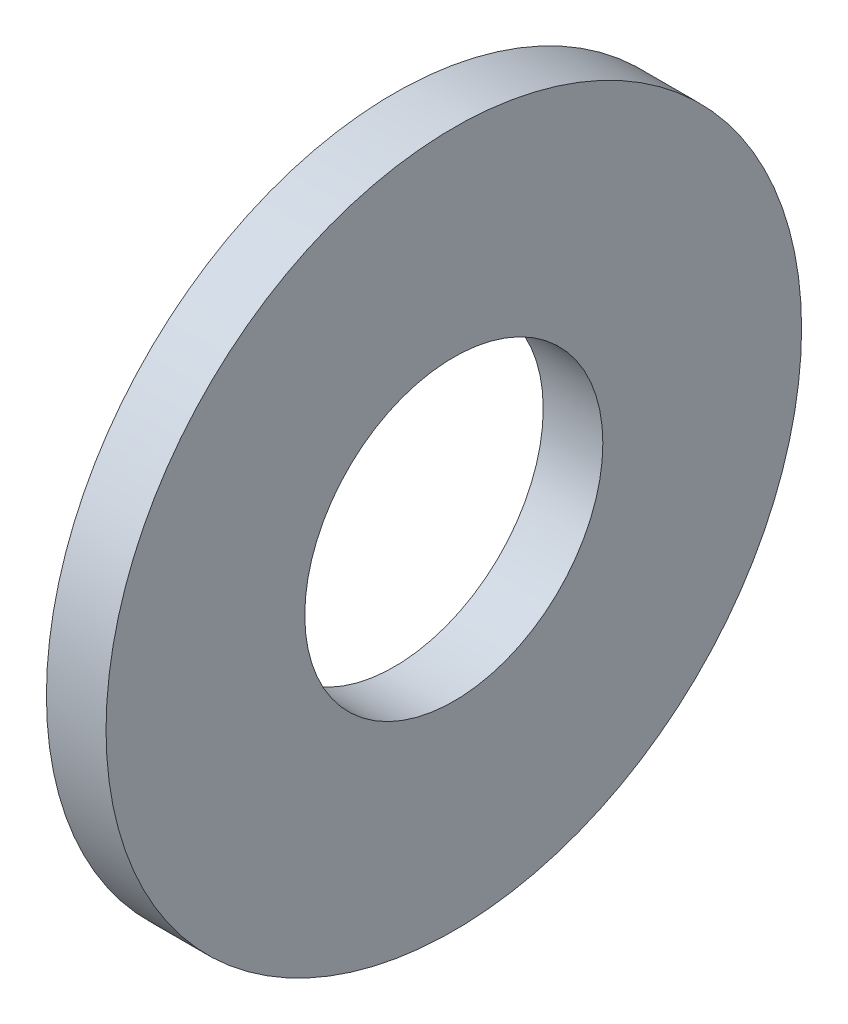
ISO-10303-21;
HEADER;
FILE_DESCRIPTION(('STEP AP214'),'2;1');
FILE_NAME('part.step','',(''),(''),'','','');
FILE_SCHEMA(('AUTOMOTIVE_DESIGN { 1 0 10303 214 1 1 1 1 }'));
ENDSEC;
DATA;
#1=APPLICATION_CONTEXT('core data for automotive mechanical design processes');
#2=APPLICATION_PROTOCOL_DEFINITION('international standard','automotive_design',2000,#1);
#3=PRODUCT_CONTEXT('',#1,'mechanical');
#4=PRODUCT('Part','Part','',(#3));
#5=PRODUCT_RELATED_PRODUCT_CATEGORY('part','',(#4));
#6=PRODUCT_DEFINITION_FORMATION('','',#4);
#7=PRODUCT_DEFINITION_CONTEXT('part definition',#1,'design');
#8=PRODUCT_DEFINITION('design','',#6,#7);
#9=PRODUCT_DEFINITION_SHAPE('','',#8);
#10=(LENGTH_UNIT() NAMED_UNIT(*) SI_UNIT(.MILLI.,.METRE.));
#11=(NAMED_UNIT(*) PLANE_ANGLE_UNIT() SI_UNIT($,.RADIAN.));
#12=(NAMED_UNIT(*) SI_UNIT($,.STERADIAN.) SOLID_ANGLE_UNIT());
#13=UNCERTAINTY_MEASURE_WITH_UNIT(LENGTH_MEASURE(1.E-05),#10,'distance_accuracy_value','');
#14=(GEOMETRIC_REPRESENTATION_CONTEXT(3) GLOBAL_UNCERTAINTY_ASSIGNED_CONTEXT((#13)) GLOBAL_UNIT_ASSIGNED_CONTEXT((#10,
#11,#12)) REPRESENTATION_CONTEXT('',''));
#15=CARTESIAN_POINT('',(0.,0.,0.));
#16=DIRECTION('',(0.,0.,1.));
#17=DIRECTION('',(1.,0.,0.));
#18=AXIS2_PLACEMENT_3D('',#15,#16,#17);
#19=CARTESIAN_POINT('',(1.905,0.,0.));
#20=DIRECTION('',(1.,0.,0.));
#21=DIRECTION('',(0.,0.,-1.));
#22=AXIS2_PLACEMENT_3D('',#19,#20,#21);
#23=PLANE('',#22);
#24=CARTESIAN_POINT('',(1.905,0.,0.));
#25=DIRECTION('',(1.,0.,0.));
#26=DIRECTION('',(0.,0.,-1.));
#27=AXIS2_PLACEMENT_3D('',#24,#25,#26);
#28=CIRCLE('',#27,11.1125);
#29=CARTESIAN_POINT('',(1.905,0.,11.1125));
#30=VERTEX_POINT('',#29);
#31=EDGE_CURVE('E10',#30,#30,#28,.T.);
#32=ORIENTED_EDGE('',*,*,#31,.T.);
#33=EDGE_LOOP('',(#32));
#34=FACE_BOUND('',#33,.T.);
#35=CARTESIAN_POINT('',(1.905,0.,0.));
#36=DIRECTION('',(1.,0.,0.));
#37=DIRECTION('',(0.,0.,-1.));
#38=AXIS2_PLACEMENT_3D('',#35,#36,#37);
#39=CIRCLE('',#38,4.7625);
#40=CARTESIAN_POINT('',(1.905,0.,4.7625));
#41=VERTEX_POINT('',#40);
#42=EDGE_CURVE('E41',#41,#41,#39,.T.);
#43=ORIENTED_EDGE('',*,*,#42,.F.);
#44=EDGE_LOOP('',(#43));
#45=FACE_BOUND('',#44,.T.);
#46=ADVANCED_FACE('F30',(#34,#45),#23,.T.);
#47=CARTESIAN_POINT('',(0.,0.,0.));
#48=DIRECTION('',(1.,0.,0.));
#49=DIRECTION('',(0.,0.,-1.));
#50=AXIS2_PLACEMENT_3D('',#47,#48,#49);
#51=PLANE('',#50);
#52=CARTESIAN_POINT('',(0.,0.,0.));
#53=DIRECTION('',(1.,0.,0.));
#54=DIRECTION('',(0.,0.,-1.));
#55=AXIS2_PLACEMENT_3D('',#52,#53,#54);
#56=CIRCLE('',#55,11.1125);
#57=CARTESIAN_POINT('',(0.,0.,11.1125));
#58=VERTEX_POINT('',#57);
#59=EDGE_CURVE('E34',#58,#58,#56,.T.);
#60=ORIENTED_EDGE('',*,*,#59,.F.);
#61=EDGE_LOOP('',(#60));
#62=FACE_BOUND('',#61,.T.);
#63=CARTESIAN_POINT('',(0.,0.,0.));
#64=DIRECTION('',(1.,0.,0.));
#65=DIRECTION('',(0.,0.,-1.));
#66=AXIS2_PLACEMENT_3D('',#63,#64,#65);
#67=CIRCLE('',#66,4.7625);
#68=CARTESIAN_POINT('',(0.,0.,4.7625));
#69=VERTEX_POINT('',#68);
#70=EDGE_CURVE('E43',#69,#69,#67,.T.);
#71=ORIENTED_EDGE('',*,*,#70,.T.);
#72=EDGE_LOOP('',(#71));
#73=FACE_BOUND('',#72,.T.);
#74=ADVANCED_FACE('F53',(#62,#73),#51,.F.);
#75=CARTESIAN_POINT('',(1.905,0.,0.));
#76=DIRECTION('',(-1.,0.,0.));
#77=DIRECTION('',(0.,0.,1.));
#78=AXIS2_PLACEMENT_3D('',#75,#76,#77);
#79=CYLINDRICAL_SURFACE('',#78,11.1125);
#80=CARTESIAN_POINT('',(1.905,0.,11.1125));
#81=CARTESIAN_POINT('',(1.88515625,0.,11.1125));
#82=CARTESIAN_POINT('',(1.8653125,0.,11.1125));
#83=CARTESIAN_POINT('',(1.825625,0.,11.1125));
#84=CARTESIAN_POINT('',(1.80578125,0.,11.1125));
#85=CARTESIAN_POINT('',(1.76609375,0.,11.1125));
#86=CARTESIAN_POINT('',(1.74625,0.,11.1125));
#87=CARTESIAN_POINT('',(1.7065625,0.,11.1125));
#88=CARTESIAN_POINT('',(1.68671875,0.,11.1125));
#89=CARTESIAN_POINT('',(1.64703125,0.,11.1125));
#90=CARTESIAN_POINT('',(1.6271875,0.,11.1125));
#91=CARTESIAN_POINT('',(1.5875,0.,11.1125));
#92=CARTESIAN_POINT('',(1.56765625,0.,11.1125));
#93=CARTESIAN_POINT('',(1.52796875,0.,11.1125));
#94=CARTESIAN_POINT('',(1.508125,0.,11.1125));
#95=CARTESIAN_POINT('',(1.4684375,0.,11.1125));
#96=CARTESIAN_POINT('',(1.44859375,0.,11.1125));
#97=CARTESIAN_POINT('',(1.40890625,0.,11.1125));
#98=CARTESIAN_POINT('',(1.3890625,0.,11.1125));
#99=CARTESIAN_POINT('',(1.349375,0.,11.1125));
#100=CARTESIAN_POINT('',(1.32953125,0.,11.1125));
#101=CARTESIAN_POINT('',(1.28984375,0.,11.1125));
#102=CARTESIAN_POINT('',(1.27,0.,11.1125));
#103=CARTESIAN_POINT('',(1.2303125,0.,11.1125));
#104=CARTESIAN_POINT('',(1.21046875,0.,11.1125));
#105=CARTESIAN_POINT('',(1.17078125,0.,11.1125));
#106=CARTESIAN_POINT('',(1.1509375,0.,11.1125));
#107=CARTESIAN_POINT('',(1.11125,0.,11.1125));
#108=CARTESIAN_POINT('',(1.09140625,0.,11.1125));
#109=CARTESIAN_POINT('',(1.05171875,0.,11.1125));
#110=CARTESIAN_POINT('',(1.031875,0.,11.1125));
#111=CARTESIAN_POINT('',(0.9921875,0.,11.1125));
#112=CARTESIAN_POINT('',(0.97234375,0.,11.1125));
#113=CARTESIAN_POINT('',(0.93265625,0.,11.1125));
#114=CARTESIAN_POINT('',(0.9128125,0.,11.1125));
#115=CARTESIAN_POINT('',(0.873125,0.,11.1125));
#116=CARTESIAN_POINT('',(0.85328125,0.,11.1125));
#117=CARTESIAN_POINT('',(0.81359375,0.,11.1125));
#118=CARTESIAN_POINT('',(0.79375,0.,11.1125));
#119=CARTESIAN_POINT('',(0.7540625,0.,11.1125));
#120=CARTESIAN_POINT('',(0.73421875,0.,11.1125));
#121=CARTESIAN_POINT('',(0.69453125,0.,11.1125));
#122=CARTESIAN_POINT('',(0.6746875,0.,11.1125));
#123=CARTESIAN_POINT('',(0.635,0.,11.1125));
#124=CARTESIAN_POINT('',(0.61515625,0.,11.1125));
#125=CARTESIAN_POINT('',(0.57546875,0.,11.1125));
#126=CARTESIAN_POINT('',(0.555625,0.,11.1125));
#127=CARTESIAN_POINT('',(0.5159375,0.,11.1125));
#128=CARTESIAN_POINT('',(0.49609375,0.,11.1125));
#129=CARTESIAN_POINT('',(0.45640625,0.,11.1125));
#130=CARTESIAN_POINT('',(0.4365625,0.,11.1125));
#131=CARTESIAN_POINT('',(0.396875,0.,11.1125));
#132=CARTESIAN_POINT('',(0.37703125,0.,11.1125));
#133=CARTESIAN_POINT('',(0.33734375,0.,11.1125));
#134=CARTESIAN_POINT('',(0.3175,0.,11.1125));
#135=CARTESIAN_POINT('',(0.2778125,0.,11.1125));
#136=CARTESIAN_POINT('',(0.25796875,0.,11.1125));
#137=CARTESIAN_POINT('',(0.21828125,0.,11.1125));
#138=CARTESIAN_POINT('',(0.1984375,0.,11.1125));
#139=CARTESIAN_POINT('',(0.15875,0.,11.1125));
#140=CARTESIAN_POINT('',(0.13890625,0.,11.1125));
#141=CARTESIAN_POINT('',(0.09921875,0.,11.1125));
#142=CARTESIAN_POINT('',(0.0793749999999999,0.,11.1125));
#143=CARTESIAN_POINT('',(0.0396874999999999,0.,11.1125));
#144=CARTESIAN_POINT('',(0.01984375,0.,11.1125));
#145=CARTESIAN_POINT('',(0.,0.,11.1125));
#146=B_SPLINE_CURVE_WITH_KNOTS('',3,(#80,#81,#82,#83,#84,#85,#86,#87,#88,#89,#90,#91,#92,#93,
#94,#95,#96,#97,#98,#99,#100,#101,#102,#103,#104,#105,#106,#107,#108,#109,#110,#111,#112,#113,
#114,#115,#116,#117,#118,#119,#120,#121,#122,#123,#124,#125,#126,#127,#128,#129,#130,#131,#132,
#133,#134,#135,#136,#137,#138,#139,#140,#141,#142,#143,#144,#145),.UNSPECIFIED.,.F.,.F.,(4,2,2,
2,2,2,2,2,2,2,2,2,2,2,2,2,2,2,2,2,2,2,2,2,2,2,2,2,2,2,2,2,4),(0.,0.0595312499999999,0.1190625,
0.17859375,0.238125,0.29765625,0.3571875,0.41671875,0.47625,0.53578125,0.5953125,0.65484375,
0.714375,0.77390625,0.833437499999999,0.89296875,0.9525,1.01203125,1.0715625,1.13109375,
1.190625,1.25015625,1.3096875,1.36921875,1.42875,1.48828125,1.5478125,1.60734375,1.666875,
1.72640625,1.7859375,1.84546875,1.905),.UNSPECIFIED.);
#147=EDGE_CURVE('BSEAM32',#30,#58,#146,.T.);
#148=ORIENTED_EDGE('',*,*,#31,.F.);
#149=ORIENTED_EDGE('',*,*,#59,.T.);
#150=ORIENTED_EDGE('',*,*,#147,.T.);
#151=ORIENTED_EDGE('',*,*,#147,.F.);
#152=EDGE_LOOP('',(#148,#150,#149,#151));
#153=FACE_BOUND('',#152,.T.);
#154=ADVANCED_FACE('F32',(#153),#79,.T.);
#155=CARTESIAN_POINT('',(1.905,0.,0.));
#156=DIRECTION('',(-1.,0.,0.));
#157=DIRECTION('',(0.,0.,1.));
#158=AXIS2_PLACEMENT_3D('',#155,#156,#157);
#159=CYLINDRICAL_SURFACE('',#158,4.7625);
#160=CARTESIAN_POINT('',(1.905,0.,4.7625));
#161=CARTESIAN_POINT('',(1.88515625,0.,4.7625));
#162=CARTESIAN_POINT('',(1.8653125,0.,4.7625));
#163=CARTESIAN_POINT('',(1.825625,0.,4.7625));
#164=CARTESIAN_POINT('',(1.80578125,0.,4.7625));
#165=CARTESIAN_POINT('',(1.76609375,0.,4.7625));
#166=CARTESIAN_POINT('',(1.74625,0.,4.7625));
#167=CARTESIAN_POINT('',(1.7065625,0.,4.7625));
#168=CARTESIAN_POINT('',(1.68671875,0.,4.7625));
#169=CARTESIAN_POINT('',(1.64703125,0.,4.7625));
#170=CARTESIAN_POINT('',(1.6271875,0.,4.7625));
#171=CARTESIAN_POINT('',(1.5875,0.,4.7625));
#172=CARTESIAN_POINT('',(1.56765625,0.,4.7625));
#173=CARTESIAN_POINT('',(1.52796875,0.,4.7625));
#174=CARTESIAN_POINT('',(1.508125,0.,4.7625));
#175=CARTESIAN_POINT('',(1.4684375,0.,4.7625));
#176=CARTESIAN_POINT('',(1.44859375,0.,4.7625));
#177=CARTESIAN_POINT('',(1.40890625,0.,4.7625));
#178=CARTESIAN_POINT('',(1.3890625,0.,4.7625));
#179=CARTESIAN_POINT('',(1.349375,0.,4.7625));
#180=CARTESIAN_POINT('',(1.32953125,0.,4.7625));
#181=CARTESIAN_POINT('',(1.28984375,0.,4.7625));
#182=CARTESIAN_POINT('',(1.27,0.,4.7625));
#183=CARTESIAN_POINT('',(1.2303125,0.,4.7625));
#184=CARTESIAN_POINT('',(1.21046875,0.,4.7625));
#185=CARTESIAN_POINT('',(1.17078125,0.,4.7625));
#186=CARTESIAN_POINT('',(1.1509375,0.,4.7625));
#187=CARTESIAN_POINT('',(1.11125,0.,4.7625));
#188=CARTESIAN_POINT('',(1.09140625,0.,4.7625));
#189=CARTESIAN_POINT('',(1.05171875,0.,4.7625));
#190=CARTESIAN_POINT('',(1.031875,0.,4.7625));
#191=CARTESIAN_POINT('',(0.9921875,0.,4.7625));
#192=CARTESIAN_POINT('',(0.97234375,0.,4.7625));
#193=CARTESIAN_POINT('',(0.93265625,0.,4.7625));
#194=CARTESIAN_POINT('',(0.9128125,0.,4.7625));
#195=CARTESIAN_POINT('',(0.873125,0.,4.7625));
#196=CARTESIAN_POINT('',(0.85328125,0.,4.7625));
#197=CARTESIAN_POINT('',(0.81359375,0.,4.7625));
#198=CARTESIAN_POINT('',(0.79375,0.,4.7625));
#199=CARTESIAN_POINT('',(0.7540625,0.,4.7625));
#200=CARTESIAN_POINT('',(0.73421875,0.,4.7625));
#201=CARTESIAN_POINT('',(0.69453125,0.,4.7625));
#202=CARTESIAN_POINT('',(0.6746875,0.,4.7625));
#203=CARTESIAN_POINT('',(0.635,0.,4.7625));
#204=CARTESIAN_POINT('',(0.61515625,0.,4.7625));
#205=CARTESIAN_POINT('',(0.57546875,0.,4.7625));
#206=CARTESIAN_POINT('',(0.555625,0.,4.7625));
#207=CARTESIAN_POINT('',(0.5159375,0.,4.7625));
#208=CARTESIAN_POINT('',(0.49609375,0.,4.7625));
#209=CARTESIAN_POINT('',(0.45640625,0.,4.7625));
#210=CARTESIAN_POINT('',(0.4365625,0.,4.7625));
#211=CARTESIAN_POINT('',(0.396875,0.,4.7625));
#212=CARTESIAN_POINT('',(0.37703125,0.,4.7625));
#213=CARTESIAN_POINT('',(0.33734375,0.,4.7625));
#214=CARTESIAN_POINT('',(0.3175,0.,4.7625));
#215=CARTESIAN_POINT('',(0.2778125,0.,4.7625));
#216=CARTESIAN_POINT('',(0.25796875,0.,4.7625));
#217=CARTESIAN_POINT('',(0.21828125,0.,4.7625));
#218=CARTESIAN_POINT('',(0.1984375,0.,4.7625));
#219=CARTESIAN_POINT('',(0.15875,0.,4.7625));
#220=CARTESIAN_POINT('',(0.13890625,0.,4.7625));
#221=CARTESIAN_POINT('',(0.09921875,0.,4.7625));
#222=CARTESIAN_POINT('',(0.0793749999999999,0.,4.7625));
#223=CARTESIAN_POINT('',(0.0396874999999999,0.,4.7625));
#224=CARTESIAN_POINT('',(0.01984375,0.,4.7625));
#225=CARTESIAN_POINT('',(0.,0.,4.7625));
#226=B_SPLINE_CURVE_WITH_KNOTS('',3,(#160,#161,#162,#163,#164,#165,#166,#167,#168,#169,#170,
#171,#172,#173,#174,#175,#176,#177,#178,#179,#180,#181,#182,#183,#184,#185,#186,#187,#188,#189,
#190,#191,#192,#193,#194,#195,#196,#197,#198,#199,#200,#201,#202,#203,#204,#205,#206,#207,#208,
#209,#210,#211,#212,#213,#214,#215,#216,#217,#218,#219,#220,#221,#222,#223,#224,#225),
.UNSPECIFIED.,.F.,.F.,(4,2,2,2,2,2,2,2,2,2,2,2,2,2,2,2,2,2,2,2,2,2,2,2,2,2,2,2,2,2,2,2,4),(0.,
0.0595312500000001,0.1190625,0.17859375,0.238125,0.29765625,0.3571875,0.41671875,0.47625,
0.53578125,0.5953125,0.65484375,0.714375,0.77390625,0.8334375,0.89296875,0.9525,1.01203125,
1.0715625,1.13109375,1.190625,1.25015625,1.3096875,1.36921875,1.42875,1.48828125,1.5478125,
1.60734375,1.666875,1.72640625,1.7859375,1.84546875,1.905),.UNSPECIFIED.);
#227=EDGE_CURVE('BSEAM49',#41,#69,#226,.T.);
#228=ORIENTED_EDGE('',*,*,#42,.T.);
#229=ORIENTED_EDGE('',*,*,#70,.F.);
#230=ORIENTED_EDGE('',*,*,#227,.T.);
#231=ORIENTED_EDGE('',*,*,#227,.F.);
#232=EDGE_LOOP('',(#228,#230,#229,#231));
#233=FACE_BOUND('',#232,.T.);
#234=ADVANCED_FACE('F49',(#233),#159,.F.);
#235=CLOSED_SHELL('',(#46,#74,#154,#234));
#236=MANIFOLD_SOLID_BREP('B2',#235);
#237=ADVANCED_BREP_SHAPE_REPRESENTATION('',(#18,#236),#14);
#238=SHAPE_DEFINITION_REPRESENTATION(#9,#237);
ENDSEC;
END-ISO-10303-21;
